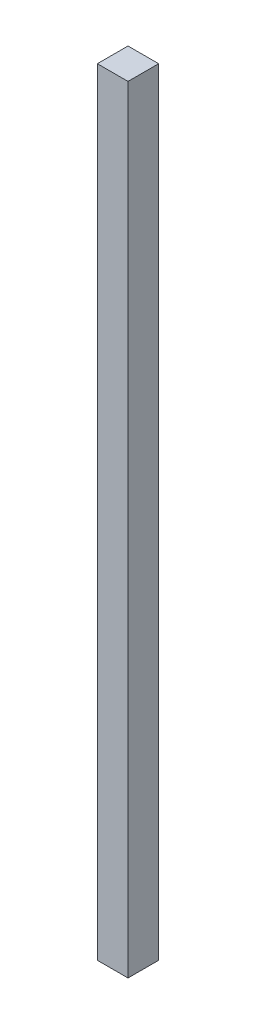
ISO-10303-21;
HEADER;
FILE_DESCRIPTION(('STEP AP214'),'2;1');
FILE_NAME('part.step','',(''),(''),'','','');
FILE_SCHEMA(('AUTOMOTIVE_DESIGN { 1 0 10303 214 1 1 1 1 }'));
ENDSEC;
DATA;
#1=APPLICATION_CONTEXT('core data for automotive mechanical design processes');
#2=APPLICATION_PROTOCOL_DEFINITION('international standard','automotive_design',2000,#1);
#3=PRODUCT_CONTEXT('',#1,'mechanical');
#4=PRODUCT('Part','Part','',(#3));
#5=PRODUCT_RELATED_PRODUCT_CATEGORY('part','',(#4));
#6=PRODUCT_DEFINITION_FORMATION('','',#4);
#7=PRODUCT_DEFINITION_CONTEXT('part definition',#1,'design');
#8=PRODUCT_DEFINITION('design','',#6,#7);
#9=PRODUCT_DEFINITION_SHAPE('','',#8);
#10=(LENGTH_UNIT() NAMED_UNIT(*) SI_UNIT(.MILLI.,.METRE.));
#11=(NAMED_UNIT(*) PLANE_ANGLE_UNIT() SI_UNIT($,.RADIAN.));
#12=(NAMED_UNIT(*) SI_UNIT($,.STERADIAN.) SOLID_ANGLE_UNIT());
#13=UNCERTAINTY_MEASURE_WITH_UNIT(LENGTH_MEASURE(1.E-05),#10,'distance_accuracy_value','');
#14=(GEOMETRIC_REPRESENTATION_CONTEXT(3) GLOBAL_UNCERTAINTY_ASSIGNED_CONTEXT((#13)) GLOBAL_UNIT_ASSIGNED_CONTEXT((#10,
#11,#12)) REPRESENTATION_CONTEXT('',''));
#15=CARTESIAN_POINT('',(0.,0.,0.));
#16=DIRECTION('',(0.,0.,1.));
#17=DIRECTION('',(1.,0.,0.));
#18=AXIS2_PLACEMENT_3D('',#15,#16,#17);
#19=CARTESIAN_POINT('',(30.,1520.,-30.));
#20=DIRECTION('',(-1.,0.,0.));
#21=DIRECTION('',(0.,0.,1.));
#22=AXIS2_PLACEMENT_3D('',#19,#20,#21);
#23=PLANE('',#22);
#24=DIRECTION('',(0.,0.,-1.));
#25=VECTOR('',#24,1.);
#26=CARTESIAN_POINT('',(30.,0.,-30.));
#27=LINE('',#26,#25);
#28=CARTESIAN_POINT('',(30.,0.,30.));
#29=VERTEX_POINT('',#28);
#30=CARTESIAN_POINT('',(30.,0.,-30.));
#31=VERTEX_POINT('',#30);
#32=EDGE_CURVE('E108',#29,#31,#27,.T.);
#33=ORIENTED_EDGE('',*,*,#32,.T.);
#34=DIRECTION('',(0.,-1.,0.));
#35=VECTOR('',#34,1.);
#36=CARTESIAN_POINT('',(30.,1520.,-30.));
#37=LINE('',#36,#35);
#38=CARTESIAN_POINT('',(30.,1520.,-30.));
#39=VERTEX_POINT('',#38);
#40=EDGE_CURVE('E11',#39,#31,#37,.T.);
#41=ORIENTED_EDGE('',*,*,#40,.F.);
#42=DIRECTION('',(0.,0.,-1.));
#43=VECTOR('',#42,1.);
#44=CARTESIAN_POINT('',(30.,1520.,-30.));
#45=LINE('',#44,#43);
#46=CARTESIAN_POINT('',(30.,1520.,30.));
#47=VERTEX_POINT('',#46);
#48=EDGE_CURVE('E96',#47,#39,#45,.T.);
#49=ORIENTED_EDGE('',*,*,#48,.F.);
#50=DIRECTION('',(0.,-1.,0.));
#51=VECTOR('',#50,1.);
#52=CARTESIAN_POINT('',(30.,1520.,30.));
#53=LINE('',#52,#51);
#54=EDGE_CURVE('E104',#47,#29,#53,.T.);
#55=ORIENTED_EDGE('',*,*,#54,.T.);
#56=EDGE_LOOP('',(#33,#41,#49,#55));
#57=FACE_BOUND('',#56,.T.);
#58=ADVANCED_FACE('F45',(#57),#23,.F.);
#59=CARTESIAN_POINT('',(-30.,1520.,-30.));
#60=DIRECTION('',(0.,0.,1.));
#61=DIRECTION('',(1.,0.,0.));
#62=AXIS2_PLACEMENT_3D('',#59,#60,#61);
#63=PLANE('',#62);
#64=DIRECTION('',(-1.,0.,0.));
#65=VECTOR('',#64,1.);
#66=CARTESIAN_POINT('',(-30.,0.,-30.));
#67=LINE('',#66,#65);
#68=CARTESIAN_POINT('',(-30.,0.,-30.));
#69=VERTEX_POINT('',#68);
#70=EDGE_CURVE('E100',#31,#69,#67,.T.);
#71=ORIENTED_EDGE('',*,*,#70,.T.);
#72=DIRECTION('',(0.,-1.,0.));
#73=VECTOR('',#72,1.);
#74=CARTESIAN_POINT('',(-30.,1520.,-30.));
#75=LINE('',#74,#73);
#76=CARTESIAN_POINT('',(-30.,1520.,-30.));
#77=VERTEX_POINT('',#76);
#78=EDGE_CURVE('E53',#77,#69,#75,.T.);
#79=ORIENTED_EDGE('',*,*,#78,.F.);
#80=DIRECTION('',(-1.,0.,0.));
#81=VECTOR('',#80,1.);
#82=CARTESIAN_POINT('',(-30.,1520.,-30.));
#83=LINE('',#82,#81);
#84=EDGE_CURVE('E91',#39,#77,#83,.T.);
#85=ORIENTED_EDGE('',*,*,#84,.F.);
#86=ORIENTED_EDGE('',*,*,#40,.T.);
#87=EDGE_LOOP('',(#71,#79,#85,#86));
#88=FACE_BOUND('',#87,.T.);
#89=ADVANCED_FACE('F99',(#88),#63,.F.);
#90=CARTESIAN_POINT('',(-30.,1520.,-30.));
#91=DIRECTION('',(1.,0.,0.));
#92=DIRECTION('',(0.,0.,-1.));
#93=AXIS2_PLACEMENT_3D('',#90,#91,#92);
#94=PLANE('',#93);
#95=DIRECTION('',(0.,0.,1.));
#96=VECTOR('',#95,1.);
#97=CARTESIAN_POINT('',(-30.,0.,-30.));
#98=LINE('',#97,#96);
#99=CARTESIAN_POINT('',(-30.,0.,30.));
#100=VERTEX_POINT('',#99);
#101=EDGE_CURVE('E78',#69,#100,#98,.T.);
#102=ORIENTED_EDGE('',*,*,#101,.T.);
#103=DIRECTION('',(0.,-1.,0.));
#104=VECTOR('',#103,1.);
#105=CARTESIAN_POINT('',(-30.,1520.,30.));
#106=LINE('',#105,#104);
#107=CARTESIAN_POINT('',(-30.,1520.,30.));
#108=VERTEX_POINT('',#107);
#109=EDGE_CURVE('E101',#108,#100,#106,.T.);
#110=ORIENTED_EDGE('',*,*,#109,.F.);
#111=DIRECTION('',(0.,0.,1.));
#112=VECTOR('',#111,1.);
#113=CARTESIAN_POINT('',(-30.,1520.,-30.));
#114=LINE('',#113,#112);
#115=EDGE_CURVE('E94',#77,#108,#114,.T.);
#116=ORIENTED_EDGE('',*,*,#115,.F.);
#117=ORIENTED_EDGE('',*,*,#78,.T.);
#118=EDGE_LOOP('',(#102,#110,#116,#117));
#119=FACE_BOUND('',#118,.T.);
#120=ADVANCED_FACE('F102',(#119),#94,.F.);
#121=CARTESIAN_POINT('',(-30.,1520.,30.));
#122=DIRECTION('',(0.,0.,-1.));
#123=DIRECTION('',(-1.,0.,0.));
#124=AXIS2_PLACEMENT_3D('',#121,#122,#123);
#125=PLANE('',#124);
#126=DIRECTION('',(1.,0.,0.));
#127=VECTOR('',#126,1.);
#128=CARTESIAN_POINT('',(-30.,0.,30.));
#129=LINE('',#128,#127);
#130=EDGE_CURVE('E84',#100,#29,#129,.T.);
#131=ORIENTED_EDGE('',*,*,#130,.T.);
#132=ORIENTED_EDGE('',*,*,#54,.F.);
#133=DIRECTION('',(1.,0.,0.));
#134=VECTOR('',#133,1.);
#135=CARTESIAN_POINT('',(-30.,1520.,30.));
#136=LINE('',#135,#134);
#137=EDGE_CURVE('E61',#108,#47,#136,.T.);
#138=ORIENTED_EDGE('',*,*,#137,.F.);
#139=ORIENTED_EDGE('',*,*,#109,.T.);
#140=EDGE_LOOP('',(#131,#132,#138,#139));
#141=FACE_BOUND('',#140,.T.);
#142=ADVANCED_FACE('F115',(#141),#125,.F.);
#143=CARTESIAN_POINT('',(0.,1520.,0.));
#144=DIRECTION('',(0.,1.,0.));
#145=DIRECTION('',(0.,0.,1.));
#146=AXIS2_PLACEMENT_3D('',#143,#144,#145);
#147=PLANE('',#146);
#148=ORIENTED_EDGE('',*,*,#48,.T.);
#149=ORIENTED_EDGE('',*,*,#84,.T.);
#150=ORIENTED_EDGE('',*,*,#115,.T.);
#151=ORIENTED_EDGE('',*,*,#137,.T.);
#152=EDGE_LOOP('',(#148,#149,#150,#151));
#153=FACE_BOUND('',#152,.T.);
#154=ADVANCED_FACE('F92',(#153),#147,.T.);
#155=CARTESIAN_POINT('',(0.,0.,0.));
#156=DIRECTION('',(0.,1.,0.));
#157=DIRECTION('',(0.,0.,1.));
#158=AXIS2_PLACEMENT_3D('',#155,#156,#157);
#159=PLANE('',#158);
#160=ORIENTED_EDGE('',*,*,#32,.F.);
#161=ORIENTED_EDGE('',*,*,#130,.F.);
#162=ORIENTED_EDGE('',*,*,#101,.F.);
#163=ORIENTED_EDGE('',*,*,#70,.F.);
#164=EDGE_LOOP('',(#160,#161,#162,#163));
#165=FACE_BOUND('',#164,.T.);
#166=ADVANCED_FACE('F118',(#165),#159,.F.);
#167=CLOSED_SHELL('',(#58,#89,#120,#142,#154,#166));
#168=MANIFOLD_SOLID_BREP('B2',#167);
#169=ADVANCED_BREP_SHAPE_REPRESENTATION('',(#18,#168),#14);
#170=SHAPE_DEFINITION_REPRESENTATION(#9,#169);
ENDSEC;
END-ISO-10303-21;
